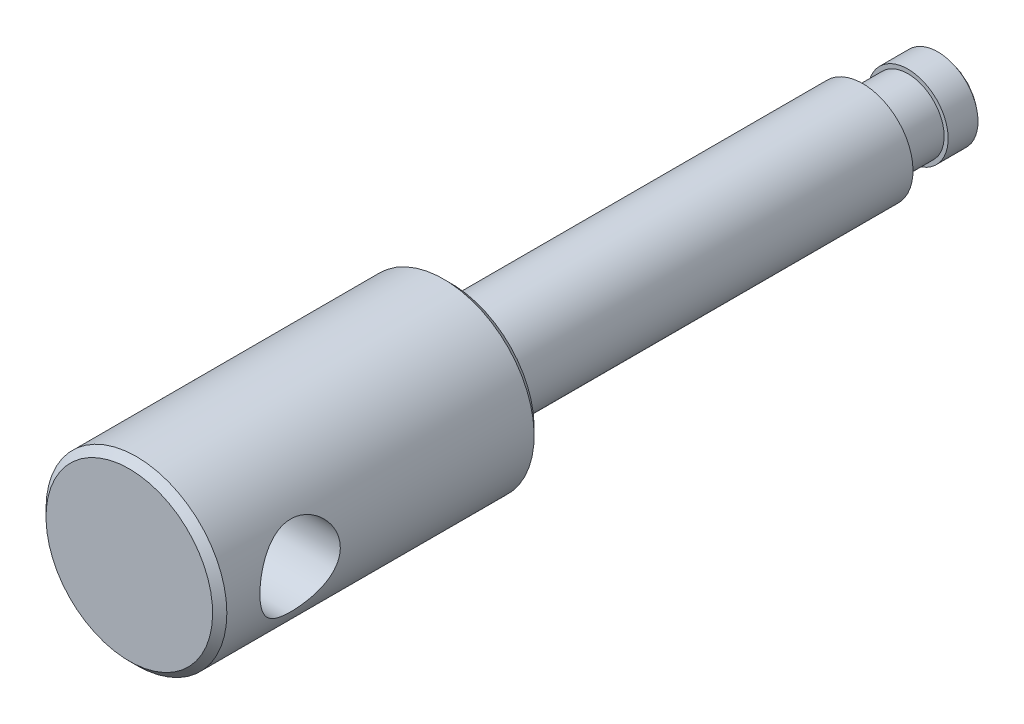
ISO-10303-21;
HEADER;
FILE_DESCRIPTION(('STEP AP214'),'2;1');
FILE_NAME('part.step','',(''),(''),'','','');
FILE_SCHEMA(('AUTOMOTIVE_DESIGN { 1 0 10303 214 1 1 1 1 }'));
ENDSEC;
DATA;
#1=APPLICATION_CONTEXT('core data for automotive mechanical design processes');
#2=APPLICATION_PROTOCOL_DEFINITION('international standard','automotive_design',2000,#1);
#3=PRODUCT_CONTEXT('',#1,'mechanical');
#4=PRODUCT('Part','Part','',(#3));
#5=PRODUCT_RELATED_PRODUCT_CATEGORY('part','',(#4));
#6=PRODUCT_DEFINITION_FORMATION('','',#4);
#7=PRODUCT_DEFINITION_CONTEXT('part definition',#1,'design');
#8=PRODUCT_DEFINITION('design','',#6,#7);
#9=PRODUCT_DEFINITION_SHAPE('','',#8);
#10=(LENGTH_UNIT() NAMED_UNIT(*) SI_UNIT(.MILLI.,.METRE.));
#11=(NAMED_UNIT(*) PLANE_ANGLE_UNIT() SI_UNIT($,.RADIAN.));
#12=(NAMED_UNIT(*) SI_UNIT($,.STERADIAN.) SOLID_ANGLE_UNIT());
#13=UNCERTAINTY_MEASURE_WITH_UNIT(LENGTH_MEASURE(1.E-05),#10,'distance_accuracy_value','');
#14=(GEOMETRIC_REPRESENTATION_CONTEXT(3) GLOBAL_UNCERTAINTY_ASSIGNED_CONTEXT((#13)) GLOBAL_UNIT_ASSIGNED_CONTEXT((#10,
#11,#12)) REPRESENTATION_CONTEXT('',''));
#15=CARTESIAN_POINT('',(0.,0.,0.));
#16=DIRECTION('',(0.,0.,1.));
#17=DIRECTION('',(1.,0.,0.));
#18=AXIS2_PLACEMENT_3D('',#15,#16,#17);
#19=CARTESIAN_POINT('',(0.,0.,6.));
#20=DIRECTION('',(-1.,0.,0.));
#21=DIRECTION('',(0.,1.,0.));
#22=AXIS2_PLACEMENT_3D('',#19,#20,#21);
#23=SPHERICAL_SURFACE('',#22,6.);
#24=CARTESIAN_POINT('',(0.,0.,1.52786404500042));
#25=DIRECTION('',(0.,0.,1.));
#26=DIRECTION('',(0.,-1.,0.));
#27=AXIS2_PLACEMENT_3D('',#24,#25,#26);
#28=CIRCLE('',#27,4.);
#29=CARTESIAN_POINT('',(0.,-4.,1.52786404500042));
#30=VERTEX_POINT('',#29);
#31=EDGE_CURVE('E112',#30,#30,#28,.T.);
#32=ORIENTED_EDGE('',*,*,#31,.F.);
#33=EDGE_LOOP('',(#32));
#34=FACE_BOUND('',#33,.T.);
#35=ADVANCED_FACE('F12',(#34),#23,.T.);
#36=CARTESIAN_POINT('',(0.,0.,0.));
#37=DIRECTION('',(0.,0.,1.));
#38=DIRECTION('',(0.,-1.,0.));
#39=AXIS2_PLACEMENT_3D('',#36,#37,#38);
#40=CYLINDRICAL_SURFACE('',#39,4.);
#41=CARTESIAN_POINT('',(0.,0.,4.5));
#42=DIRECTION('',(0.,0.,1.));
#43=DIRECTION('',(0.,-1.,0.));
#44=AXIS2_PLACEMENT_3D('',#41,#42,#43);
#45=CIRCLE('',#44,4.);
#46=CARTESIAN_POINT('',(0.,-4.,4.5));
#47=VERTEX_POINT('',#46);
#48=EDGE_CURVE('E113',#47,#47,#45,.F.);
#49=ORIENTED_EDGE('',*,*,#48,.T.);
#50=EDGE_LOOP('',(#49));
#51=FACE_BOUND('',#50,.T.);
#52=ORIENTED_EDGE('',*,*,#31,.T.);
#53=EDGE_LOOP('',(#52));
#54=FACE_BOUND('',#53,.T.);
#55=ADVANCED_FACE('F75',(#51,#54),#40,.T.);
#56=CARTESIAN_POINT('',(3.6,0.,4.5));
#57=DIRECTION('',(0.,0.,-1.));
#58=DIRECTION('',(0.,1.,0.));
#59=AXIS2_PLACEMENT_3D('',#56,#57,#58);
#60=PLANE('',#59);
#61=CARTESIAN_POINT('',(0.,0.,4.5));
#62=DIRECTION('',(0.,0.,1.));
#63=DIRECTION('',(0.,-1.,0.));
#64=AXIS2_PLACEMENT_3D('',#61,#62,#63);
#65=CIRCLE('',#64,3.6);
#66=CARTESIAN_POINT('',(0.,-3.6,4.5));
#67=VERTEX_POINT('',#66);
#68=EDGE_CURVE('E94',#67,#67,#65,.T.);
#69=ORIENTED_EDGE('',*,*,#68,.F.);
#70=EDGE_LOOP('',(#69));
#71=FACE_BOUND('',#70,.T.);
#72=ORIENTED_EDGE('',*,*,#48,.F.);
#73=EDGE_LOOP('',(#72));
#74=FACE_BOUND('',#73,.T.);
#75=ADVANCED_FACE('F71',(#71,#74),#60,.F.);
#76=CARTESIAN_POINT('',(0.,0.,0.));
#77=DIRECTION('',(0.,0.,1.));
#78=DIRECTION('',(0.,-1.,0.));
#79=AXIS2_PLACEMENT_3D('',#76,#77,#78);
#80=CYLINDRICAL_SURFACE('',#79,3.6);
#81=CARTESIAN_POINT('',(0.,0.,8.19170962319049));
#82=DIRECTION('',(0.,0.,1.));
#83=DIRECTION('',(0.,-1.,0.));
#84=AXIS2_PLACEMENT_3D('',#81,#82,#83);
#85=CIRCLE('',#84,3.60000000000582);
#86=CARTESIAN_POINT('',(0.,-3.60000000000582,8.19170962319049));
#87=VERTEX_POINT('',#86);
#88=EDGE_CURVE('E90',#87,#87,#85,.T.);
#89=ORIENTED_EDGE('',*,*,#88,.F.);
#90=EDGE_LOOP('',(#89));
#91=FACE_BOUND('',#90,.T.);
#92=ORIENTED_EDGE('',*,*,#68,.T.);
#93=EDGE_LOOP('',(#92));
#94=FACE_BOUND('',#93,.T.);
#95=ADVANCED_FACE('F67',(#91,#94),#80,.T.);
#96=CARTESIAN_POINT('',(0.,0.,9.00000000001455));
#97=DIRECTION('',(0.,0.,1.));
#98=DIRECTION('',(0.,-1.,0.));
#99=AXIS2_PLACEMENT_3D('',#96,#97,#98);
#100=CONICAL_SURFACE('',#99,4.99999999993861,1.047197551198);
#101=CARTESIAN_POINT('',(0.,0.,9.));
#102=DIRECTION('',(0.,0.,1.));
#103=DIRECTION('',(0.,-1.,0.));
#104=AXIS2_PLACEMENT_3D('',#101,#102,#103);
#105=CIRCLE('',#104,5.);
#106=CARTESIAN_POINT('',(0.,-5.,9.));
#107=VERTEX_POINT('',#106);
#108=EDGE_CURVE('E97',#107,#107,#105,.T.);
#109=ORIENTED_EDGE('',*,*,#108,.F.);
#110=EDGE_LOOP('',(#109));
#111=FACE_BOUND('',#110,.T.);
#112=ORIENTED_EDGE('',*,*,#88,.T.);
#113=EDGE_LOOP('',(#112));
#114=FACE_BOUND('',#113,.T.);
#115=ADVANCED_FACE('F63',(#111,#114),#100,.T.);
#116=CARTESIAN_POINT('',(0.,0.,0.));
#117=DIRECTION('',(0.,0.,1.));
#118=DIRECTION('',(0.,-1.,0.));
#119=AXIS2_PLACEMENT_3D('',#116,#117,#118);
#120=CYLINDRICAL_SURFACE('',#119,5.);
#121=CARTESIAN_POINT('',(0.,0.,50.));
#122=DIRECTION('',(0.,0.,1.));
#123=DIRECTION('',(0.,-1.,0.));
#124=AXIS2_PLACEMENT_3D('',#121,#122,#123);
#125=CIRCLE('',#124,5.);
#126=CARTESIAN_POINT('',(0.,-5.,50.));
#127=VERTEX_POINT('',#126);
#128=EDGE_CURVE('E93',#127,#127,#125,.F.);
#129=ORIENTED_EDGE('',*,*,#128,.T.);
#130=EDGE_LOOP('',(#129));
#131=FACE_BOUND('',#130,.T.);
#132=ORIENTED_EDGE('',*,*,#108,.T.);
#133=EDGE_LOOP('',(#132));
#134=FACE_BOUND('',#133,.T.);
#135=ADVANCED_FACE('F59',(#131,#134),#120,.T.);
#136=CARTESIAN_POINT('',(8.29289321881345,0.,50.));
#137=DIRECTION('',(0.,0.,1.));
#138=DIRECTION('',(0.,-1.,0.));
#139=AXIS2_PLACEMENT_3D('',#136,#137,#138);
#140=PLANE('',#139);
#141=CARTESIAN_POINT('',(0.,0.,50.));
#142=DIRECTION('',(0.,0.,1.));
#143=DIRECTION('',(0.,-1.,0.));
#144=AXIS2_PLACEMENT_3D('',#141,#142,#143);
#145=CIRCLE('',#144,8.29289321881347);
#146=CARTESIAN_POINT('',(0.,-8.29289321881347,50.));
#147=VERTEX_POINT('',#146);
#148=EDGE_CURVE('E100',#147,#147,#145,.T.);
#149=ORIENTED_EDGE('',*,*,#148,.F.);
#150=EDGE_LOOP('',(#149));
#151=FACE_BOUND('',#150,.T.);
#152=ORIENTED_EDGE('',*,*,#128,.F.);
#153=EDGE_LOOP('',(#152));
#154=FACE_BOUND('',#153,.T.);
#155=ADVANCED_FACE('F55',(#151,#154),#140,.F.);
#156=CARTESIAN_POINT('',(0.,0.,82.));
#157=DIRECTION('',(0.,0.,-1.));
#158=DIRECTION('',(0.,1.,0.));
#159=AXIS2_PLACEMENT_3D('',#156,#157,#158);
#160=PLANE('',#159);
#161=CARTESIAN_POINT('',(0.,0.,82.));
#162=DIRECTION('',(0.,0.,-1.));
#163=DIRECTION('',(0.,1.,0.));
#164=AXIS2_PLACEMENT_3D('',#161,#162,#163);
#165=CIRCLE('',#164,8.29289321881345);
#166=CARTESIAN_POINT('',(0.,8.29289321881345,82.));
#167=VERTEX_POINT('',#166);
#168=EDGE_CURVE('E86',#167,#167,#165,.T.);
#169=ORIENTED_EDGE('',*,*,#168,.F.);
#170=EDGE_LOOP('',(#169));
#171=FACE_BOUND('',#170,.T.);
#172=ADVANCED_FACE('F51',(#171),#160,.F.);
#173=CARTESIAN_POINT('',(0.,0.,50.7071067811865));
#174=DIRECTION('',(0.,0.,1.));
#175=DIRECTION('',(0.,-1.,0.));
#176=AXIS2_PLACEMENT_3D('',#173,#174,#175);
#177=CONICAL_SURFACE('',#176,9.,0.785398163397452);
#178=CARTESIAN_POINT('',(0.,0.,50.7071067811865));
#179=DIRECTION('',(0.,0.,1.));
#180=DIRECTION('',(0.,-1.,0.));
#181=AXIS2_PLACEMENT_3D('',#178,#179,#180);
#182=CIRCLE('',#181,9.);
#183=CARTESIAN_POINT('',(0.,-9.,50.7071067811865));
#184=VERTEX_POINT('',#183);
#185=EDGE_CURVE('E27',#184,#184,#182,.T.);
#186=ORIENTED_EDGE('',*,*,#185,.F.);
#187=EDGE_LOOP('',(#186));
#188=FACE_BOUND('',#187,.T.);
#189=ORIENTED_EDGE('',*,*,#148,.T.);
#190=EDGE_LOOP('',(#189));
#191=FACE_BOUND('',#190,.T.);
#192=ADVANCED_FACE('F47',(#188,#191),#177,.T.);
#193=CARTESIAN_POINT('',(0.,0.,81.2928932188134));
#194=DIRECTION('',(0.,0.,-1.));
#195=DIRECTION('',(0.,1.,0.));
#196=AXIS2_PLACEMENT_3D('',#193,#194,#195);
#197=CONICAL_SURFACE('',#196,9.,0.785398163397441);
#198=ORIENTED_EDGE('',*,*,#168,.T.);
#199=EDGE_LOOP('',(#198));
#200=FACE_BOUND('',#199,.T.);
#201=CARTESIAN_POINT('',(0.,0.,81.2928932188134));
#202=DIRECTION('',(0.,0.,1.));
#203=DIRECTION('',(0.,-1.,0.));
#204=AXIS2_PLACEMENT_3D('',#201,#202,#203);
#205=CIRCLE('',#204,9.);
#206=CARTESIAN_POINT('',(0.,-9.,81.2928932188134));
#207=VERTEX_POINT('',#206);
#208=EDGE_CURVE('E31',#207,#207,#205,.F.);
#209=ORIENTED_EDGE('',*,*,#208,.F.);
#210=EDGE_LOOP('',(#209));
#211=FACE_BOUND('',#210,.T.);
#212=ADVANCED_FACE('F42',(#200,#211),#197,.T.);
#213=CARTESIAN_POINT('',(0.,0.,0.));
#214=DIRECTION('',(0.,0.,1.));
#215=DIRECTION('',(0.,-1.,0.));
#216=AXIS2_PLACEMENT_3D('',#213,#214,#215);
#217=CYLINDRICAL_SURFACE('',#216,9.);
#218=CARTESIAN_POINT('',(-8.06225774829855,4.,74.));
#219=CARTESIAN_POINT('',(-8.06225871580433,3.99999911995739,73.8940426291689));
#220=CARTESIAN_POINT('',(-8.06435392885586,3.99578365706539,73.7880560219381));
#221=CARTESIAN_POINT('',(-8.07266315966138,3.9789689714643,73.5768687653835));
#222=CARTESIAN_POINT('',(-8.07887962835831,3.96636475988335,73.4716686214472));
#223=CARTESIAN_POINT('',(-8.09523141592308,3.93288406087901,73.2626821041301));
#224=CARTESIAN_POINT('',(-8.10537442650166,3.91199133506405,73.1588989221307));
#225=CARTESIAN_POINT('',(-8.12922894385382,3.8621744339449,72.9536831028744));
#226=CARTESIAN_POINT('',(-8.1429419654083,3.83324684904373,72.8522514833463));
#227=CARTESIAN_POINT('',(-8.18864631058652,3.73514516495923,72.5534876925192));
#228=CARTESIAN_POINT('',(-8.2253027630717,3.65446024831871,72.3605118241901));
#229=CARTESIAN_POINT('',(-8.30683459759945,3.46512080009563,71.9909863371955));
#230=CARTESIAN_POINT('',(-8.35170881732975,3.35647022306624,71.8144344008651));
#231=CARTESIAN_POINT('',(-8.44818605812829,3.1060059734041,71.469998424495));
#232=CARTESIAN_POINT('',(-8.50003637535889,2.96250577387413,71.3034071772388));
#233=CARTESIAN_POINT('',(-8.60260345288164,2.64995455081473,70.9956903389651));
#234=CARTESIAN_POINT('',(-8.65331973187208,2.48089290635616,70.8545753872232));
#235=CARTESIAN_POINT('',(-8.75098098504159,2.11153557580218,70.5948734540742));
#236=CARTESIAN_POINT('',(-8.79760568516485,1.91009295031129,70.477786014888));
#237=CARTESIAN_POINT('',(-8.87874924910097,1.48791769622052,70.2797334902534));
#238=CARTESIAN_POINT('',(-8.91327418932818,1.26719481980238,70.1987502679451));
#239=CARTESIAN_POINT('',(-8.96456719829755,0.826358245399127,70.0800307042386));
#240=CARTESIAN_POINT('',(-8.98225241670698,0.606957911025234,70.0400501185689));
#241=CARTESIAN_POINT('',(-9.00123386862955,0.163899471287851,69.9971753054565));
#242=CARTESIAN_POINT('',(-9.00253773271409,-0.0597566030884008,69.9942638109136));
#243=CARTESIAN_POINT('',(-8.9891172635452,-0.488489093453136,70.0245297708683));
#244=CARTESIAN_POINT('',(-8.97549378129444,-0.69378181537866,70.0552284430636));
#245=CARTESIAN_POINT('',(-8.93530946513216,-1.09594639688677,70.1475366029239));
#246=CARTESIAN_POINT('',(-8.90874767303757,-1.2928176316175,70.2091483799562));
#247=CARTESIAN_POINT('',(-8.84470124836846,-1.67619924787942,70.3621943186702));
#248=CARTESIAN_POINT('',(-8.80705628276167,-1.86250594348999,70.4540687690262));
#249=CARTESIAN_POINT('',(-8.72443358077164,-2.2175508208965,70.6645696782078));
#250=CARTESIAN_POINT('',(-8.67945317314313,-2.38628256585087,70.7832058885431));
#251=CARTESIAN_POINT('',(-8.58241773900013,-2.7154801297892,71.054628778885));
#252=CARTESIAN_POINT('',(-8.53008453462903,-2.8742540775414,71.209366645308));
#253=CARTESIAN_POINT('',(-8.42674548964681,-3.16444740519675,71.5433403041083));
#254=CARTESIAN_POINT('',(-8.37574032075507,-3.29585316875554,71.7225882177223));
#255=CARTESIAN_POINT('',(-8.30349353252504,-3.47221412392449,72.0107379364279));
#256=CARTESIAN_POINT('',(-8.27968910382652,-3.52844732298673,72.1122551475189));
#257=CARTESIAN_POINT('',(-8.23475847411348,-3.63207089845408,72.3202557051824));
#258=CARTESIAN_POINT('',(-8.2136310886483,-3.67946519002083,72.4267368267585));
#259=CARTESIAN_POINT('',(-8.17480574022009,-3.76493796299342,72.6439523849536));
#260=CARTESIAN_POINT('',(-8.15710705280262,-3.80301841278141,72.754685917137));
#261=CARTESIAN_POINT('',(-8.12581877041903,-3.86942100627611,72.9795529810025));
#262=CARTESIAN_POINT('',(-8.11222690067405,-3.89774855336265,73.0936845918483));
#263=CARTESIAN_POINT('',(-8.09048889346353,-3.94265987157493,73.3163267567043));
#264=CARTESIAN_POINT('',(-8.08202710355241,-3.95992921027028,73.4246684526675));
#265=CARTESIAN_POINT('',(-8.06944257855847,-3.98551143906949,73.6426081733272));
#266=CARTESIAN_POINT('',(-8.06531779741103,-3.99382855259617,73.7522055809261));
#267=CARTESIAN_POINT('',(-8.06156002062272,-4.00140826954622,73.9717723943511));
#268=CARTESIAN_POINT('',(-8.06192629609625,-4.00067234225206,74.0817417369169));
#269=CARTESIAN_POINT('',(-8.06713428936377,-3.99016019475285,74.3011360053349));
#270=CARTESIAN_POINT('',(-8.07197583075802,-3.9803843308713,74.4105609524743));
#271=CARTESIAN_POINT('',(-8.08540695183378,-3.95302498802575,74.6195308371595));
#272=CARTESIAN_POINT('',(-8.09367676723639,-3.93610575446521,74.7191839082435));
#273=CARTESIAN_POINT('',(-8.11360050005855,-3.89486887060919,74.9166144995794));
#274=CARTESIAN_POINT('',(-8.12525556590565,-3.87054870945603,75.0143913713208));
#275=CARTESIAN_POINT('',(-8.16479240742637,-3.78682316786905,75.3039409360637));
#276=CARTESIAN_POINT('',(-8.19725658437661,-3.71663214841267,75.4920869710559));
#277=CARTESIAN_POINT('',(-8.27248834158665,-3.54611617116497,75.8623985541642));
#278=CARTESIAN_POINT('',(-8.31565196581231,-3.44458335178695,76.0439197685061));
#279=CARTESIAN_POINT('',(-8.40692978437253,-3.21539109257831,76.3883189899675));
#280=CARTESIAN_POINT('',(-8.45504630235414,-3.08771936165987,76.5511881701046));
#281=CARTESIAN_POINT('',(-8.55631670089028,-2.79562298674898,76.8697587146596));
#282=CARTESIAN_POINT('',(-8.6095148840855,-2.62885906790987,77.0233092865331));
#283=CARTESIAN_POINT('',(-8.71080374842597,-2.2707901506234,77.3007272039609));
#284=CARTESIAN_POINT('',(-8.75889370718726,-2.07948168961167,77.4245903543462));
#285=CARTESIAN_POINT('',(-8.84519710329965,-1.67498083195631,77.6396869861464));
#286=CARTESIAN_POINT('',(-8.88332261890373,-1.46161537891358,77.730632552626));
#287=CARTESIAN_POINT('',(-8.94472578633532,-1.02045840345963,77.8745834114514));
#288=CARTESIAN_POINT('',(-8.96801362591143,-0.792676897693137,77.9276147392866));
#289=CARTESIAN_POINT('',(-8.99580137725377,-0.348228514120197,77.9906336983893));
#290=CARTESIAN_POINT('',(-9.00161841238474,-0.132069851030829,78.00364083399));
#291=CARTESIAN_POINT('',(-8.99760436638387,0.299340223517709,77.9946102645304));
#292=CARTESIAN_POINT('',(-8.98777674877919,0.514591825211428,77.9725803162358));
#293=CARTESIAN_POINT('',(-8.954312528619,0.928153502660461,77.8962552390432));
#294=CARTESIAN_POINT('',(-8.93130800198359,1.12679150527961,77.8434351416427));
#295=CARTESIAN_POINT('',(-8.87418367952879,1.51223596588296,77.7087522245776));
#296=CARTESIAN_POINT('',(-8.84006193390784,1.69904034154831,77.6268843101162));
#297=CARTESIAN_POINT('',(-8.76198674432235,2.06499399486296,77.4323035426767));
#298=CARTESIAN_POINT('',(-8.71765436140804,2.24339999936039,77.3183489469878));
#299=CARTESIAN_POINT('',(-8.62423537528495,2.57934407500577,77.0645296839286));
#300=CARTESIAN_POINT('',(-8.5751467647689,2.73687326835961,76.9246540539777));
#301=CARTESIAN_POINT('',(-8.47281938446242,3.03954409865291,76.6100798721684));
#302=CARTESIAN_POINT('',(-8.41955831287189,3.18273227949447,76.4335061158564));
#303=CARTESIAN_POINT('',(-8.31863267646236,3.43791440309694,76.057266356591));
#304=CARTESIAN_POINT('',(-8.27097161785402,3.5498888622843,75.8575860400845));
#305=CARTESIAN_POINT('',(-8.20816019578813,3.69171847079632,75.5441803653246));
#306=CARTESIAN_POINT('',(-8.18863116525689,3.73471557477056,75.4371069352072));
#307=CARTESIAN_POINT('',(-8.15320381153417,3.81143772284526,75.219125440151));
#308=CARTESIAN_POINT('',(-8.13730367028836,3.845167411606,75.1082193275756));
#309=CARTESIAN_POINT('',(-8.10978099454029,3.90288007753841,74.8837044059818));
#310=CARTESIAN_POINT('',(-8.09814723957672,3.92688863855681,74.7701035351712));
#311=CARTESIAN_POINT('',(-8.07957808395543,3.96495546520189,74.5409253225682));
#312=CARTESIAN_POINT('',(-8.07263915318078,3.9790212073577,74.4253495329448));
#313=CARTESIAN_POINT('',(-8.06621715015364,3.99201145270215,74.2578957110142));
#314=CARTESIAN_POINT('',(-8.06473388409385,3.99500589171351,74.2063769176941));
#315=CARTESIAN_POINT('',(-8.06275393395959,3.999000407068,74.103241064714));
#316=CARTESIAN_POINT('',(-8.06225727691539,4.00000042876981,74.0516240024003));
#317=CARTESIAN_POINT('',(-8.06225774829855,4.,74.));
#318=B_SPLINE_CURVE_WITH_KNOTS('',3,(#218,#219,#220,#221,#222,#223,#224,#225,#226,#227,#228,
#229,#230,#231,#232,#233,#234,#235,#236,#237,#238,#239,#240,#241,#242,#243,#244,#245,#246,#247,
#248,#249,#250,#251,#252,#253,#254,#255,#256,#257,#258,#259,#260,#261,#262,#263,#264,#265,#266,
#267,#268,#269,#270,#271,#272,#273,#274,#275,#276,#277,#278,#279,#280,#281,#282,#283,#284,#285,
#286,#287,#288,#289,#290,#291,#292,#293,#294,#295,#296,#297,#298,#299,#300,#301,#302,#303,#304,
#305,#306,#307,#308,#309,#310,#311,#312,#313,#314,#315,#316,#317),.UNSPECIFIED.,.T.,.F.,(4,2,2,
2,2,2,2,2,2,2,2,2,2,2,2,2,2,2,2,2,2,2,2,2,2,2,2,2,2,2,2,2,2,2,2,2,2,2,2,2,2,2,2,2,2,2,2,2,2,4),
(0.,0.317818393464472,0.635825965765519,0.954459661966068,1.27322877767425,1.90722874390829,
2.54113910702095,3.21592082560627,3.89098369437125,4.60017396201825,5.30900756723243,
5.97655382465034,6.64378912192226,7.26493832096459,7.88613352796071,8.51679809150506,
9.14769283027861,9.82817138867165,10.5089876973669,10.8640051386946,11.2188649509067,
11.5736497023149,11.9282375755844,12.2578989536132,12.5874047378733,12.9168570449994,
13.2462963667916,13.5501886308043,13.8541841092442,14.4617122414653,15.0964254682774,
15.7314378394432,16.4267756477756,17.1222116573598,17.8235911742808,18.5244885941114,
19.1710234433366,19.8174151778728,20.435125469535,21.0529441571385,21.6990794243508,
22.3454885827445,23.0428199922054,23.7405857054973,24.0912600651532,24.4417583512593,
24.7913281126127,25.1406347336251,25.2954763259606,25.4503221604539),.UNSPECIFIED.);
#319=CARTESIAN_POINT('',(-8.06225774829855,4.,74.));
#320=VERTEX_POINT('',#319);
#321=EDGE_CURVE('E23',#320,#320,#318,.T.);
#322=ORIENTED_EDGE('',*,*,#321,.F.);
#323=EDGE_LOOP('',(#322));
#324=FACE_BOUND('',#323,.T.);
#325=ORIENTED_EDGE('',*,*,#208,.T.);
#326=EDGE_LOOP('',(#325));
#327=FACE_BOUND('',#326,.T.);
#328=CARTESIAN_POINT('',(8.06225774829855,4.,74.));
#329=CARTESIAN_POINT('',(8.06225871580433,3.99999911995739,74.1059573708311));
#330=CARTESIAN_POINT('',(8.06435392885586,3.99578365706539,74.2119439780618));
#331=CARTESIAN_POINT('',(8.07266315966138,3.9789689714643,74.4231312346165));
#332=CARTESIAN_POINT('',(8.07887962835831,3.96636475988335,74.5283313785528));
#333=CARTESIAN_POINT('',(8.09523141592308,3.93288406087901,74.7373178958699));
#334=CARTESIAN_POINT('',(8.10537442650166,3.91199133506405,74.8411010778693));
#335=CARTESIAN_POINT('',(8.12922894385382,3.8621744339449,75.0463168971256));
#336=CARTESIAN_POINT('',(8.1429419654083,3.83324684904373,75.1477485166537));
#337=CARTESIAN_POINT('',(8.18864631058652,3.73514516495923,75.4465123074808));
#338=CARTESIAN_POINT('',(8.2253027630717,3.6544602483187,75.6394881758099));
#339=CARTESIAN_POINT('',(8.30683459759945,3.46512080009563,76.0090136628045));
#340=CARTESIAN_POINT('',(8.35170881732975,3.35647022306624,76.1855655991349));
#341=CARTESIAN_POINT('',(8.44818605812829,3.1060059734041,76.530001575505));
#342=CARTESIAN_POINT('',(8.50003637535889,2.96250577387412,76.6965928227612));
#343=CARTESIAN_POINT('',(8.60260345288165,2.64995455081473,77.0043096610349));
#344=CARTESIAN_POINT('',(8.65331973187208,2.48089290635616,77.1454246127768));
#345=CARTESIAN_POINT('',(8.75098098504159,2.11153557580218,77.4051265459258));
#346=CARTESIAN_POINT('',(8.79760568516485,1.91009295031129,77.522213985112));
#347=CARTESIAN_POINT('',(8.87874924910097,1.48791769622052,77.7202665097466));
#348=CARTESIAN_POINT('',(8.91327418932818,1.26719481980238,77.8012497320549));
#349=CARTESIAN_POINT('',(8.96456719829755,0.826358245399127,77.9199692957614));
#350=CARTESIAN_POINT('',(8.98225241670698,0.606957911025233,77.9599498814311));
#351=CARTESIAN_POINT('',(9.00123386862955,0.16389947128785,78.0028246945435));
#352=CARTESIAN_POINT('',(9.00253773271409,-0.0597566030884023,78.0057361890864));
#353=CARTESIAN_POINT('',(8.9891172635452,-0.488489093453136,77.9754702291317));
#354=CARTESIAN_POINT('',(8.97549378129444,-0.693781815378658,77.9447715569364));
#355=CARTESIAN_POINT('',(8.93530946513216,-1.09594639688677,77.8524633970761));
#356=CARTESIAN_POINT('',(8.90874767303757,-1.2928176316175,77.7908516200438));
#357=CARTESIAN_POINT('',(8.84470124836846,-1.67619924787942,77.6378056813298));
#358=CARTESIAN_POINT('',(8.80705628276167,-1.86250594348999,77.5459312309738));
#359=CARTESIAN_POINT('',(8.72443358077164,-2.2175508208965,77.3354303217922));
#360=CARTESIAN_POINT('',(8.67945317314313,-2.38628256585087,77.2167941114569));
#361=CARTESIAN_POINT('',(8.58241773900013,-2.71548012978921,76.945371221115));
#362=CARTESIAN_POINT('',(8.53008453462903,-2.8742540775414,76.790633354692));
#363=CARTESIAN_POINT('',(8.42674548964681,-3.16444740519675,76.4566596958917));
#364=CARTESIAN_POINT('',(8.37574032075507,-3.29585316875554,76.2774117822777));
#365=CARTESIAN_POINT('',(8.30349353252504,-3.47221412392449,75.9892620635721));
#366=CARTESIAN_POINT('',(8.27968910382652,-3.52844732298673,75.8877448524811));
#367=CARTESIAN_POINT('',(8.23475847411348,-3.63207089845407,75.6797442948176));
#368=CARTESIAN_POINT('',(8.2136310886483,-3.67946519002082,75.5732631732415));
#369=CARTESIAN_POINT('',(8.17480574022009,-3.76493796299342,75.3560476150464));
#370=CARTESIAN_POINT('',(8.15710705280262,-3.80301841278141,75.245314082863));
#371=CARTESIAN_POINT('',(8.12581877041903,-3.86942100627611,75.0204470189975));
#372=CARTESIAN_POINT('',(8.11222690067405,-3.89774855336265,74.9063154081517));
#373=CARTESIAN_POINT('',(8.09048889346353,-3.94265987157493,74.6836732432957));
#374=CARTESIAN_POINT('',(8.08202710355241,-3.95992921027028,74.5753315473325));
#375=CARTESIAN_POINT('',(8.06944257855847,-3.98551143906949,74.3573918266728));
#376=CARTESIAN_POINT('',(8.06531779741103,-3.99382855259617,74.2477944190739));
#377=CARTESIAN_POINT('',(8.06156002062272,-4.00140826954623,74.0282276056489));
#378=CARTESIAN_POINT('',(8.06192629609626,-4.00067234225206,73.9182582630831));
#379=CARTESIAN_POINT('',(8.06713428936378,-3.99016019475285,73.6988639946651));
#380=CARTESIAN_POINT('',(8.07197583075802,-3.9803843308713,73.5894390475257));
#381=CARTESIAN_POINT('',(8.08540695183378,-3.95302498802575,73.3804691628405));
#382=CARTESIAN_POINT('',(8.09367676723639,-3.93610575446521,73.2808160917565));
#383=CARTESIAN_POINT('',(8.11360050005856,-3.89486887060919,73.0833855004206));
#384=CARTESIAN_POINT('',(8.12525556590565,-3.87054870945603,72.9856086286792));
#385=CARTESIAN_POINT('',(8.16479240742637,-3.78682316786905,72.6960590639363));
#386=CARTESIAN_POINT('',(8.19725658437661,-3.71663214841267,72.5079130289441));
#387=CARTESIAN_POINT('',(8.27248834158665,-3.54611617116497,72.1376014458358));
#388=CARTESIAN_POINT('',(8.31565196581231,-3.44458335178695,71.956080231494));
#389=CARTESIAN_POINT('',(8.40692978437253,-3.21539109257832,71.6116810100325));
#390=CARTESIAN_POINT('',(8.45504630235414,-3.08771936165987,71.4488118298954));
#391=CARTESIAN_POINT('',(8.55631670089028,-2.79562298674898,71.1302412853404));
#392=CARTESIAN_POINT('',(8.6095148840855,-2.62885906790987,70.9766907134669));
#393=CARTESIAN_POINT('',(8.71080374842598,-2.2707901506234,70.6992727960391));
#394=CARTESIAN_POINT('',(8.75889370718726,-2.07948168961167,70.5754096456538));
#395=CARTESIAN_POINT('',(8.84519710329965,-1.67498083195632,70.3603130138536));
#396=CARTESIAN_POINT('',(8.88332261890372,-1.46161537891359,70.269367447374));
#397=CARTESIAN_POINT('',(8.94472578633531,-1.02045840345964,70.1254165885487));
#398=CARTESIAN_POINT('',(8.96801362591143,-0.792676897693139,70.0723852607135));
#399=CARTESIAN_POINT('',(8.99580137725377,-0.348228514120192,70.0093663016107));
#400=CARTESIAN_POINT('',(9.00161841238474,-0.132069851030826,69.99635916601));
#401=CARTESIAN_POINT('',(8.99760436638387,0.299340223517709,70.0053897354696));
#402=CARTESIAN_POINT('',(8.98777674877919,0.514591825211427,70.0274196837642));
#403=CARTESIAN_POINT('',(8.954312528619,0.928153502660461,70.1037447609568));
#404=CARTESIAN_POINT('',(8.93130800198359,1.12679150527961,70.1565648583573));
#405=CARTESIAN_POINT('',(8.87418367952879,1.51223596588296,70.2912477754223));
#406=CARTESIAN_POINT('',(8.84006193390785,1.69904034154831,70.3731156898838));
#407=CARTESIAN_POINT('',(8.76198674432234,2.06499399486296,70.5676964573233));
#408=CARTESIAN_POINT('',(8.71765436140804,2.24339999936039,70.6816510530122));
#409=CARTESIAN_POINT('',(8.62423537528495,2.57934407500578,70.9354703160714));
#410=CARTESIAN_POINT('',(8.5751467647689,2.73687326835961,71.0753459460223));
#411=CARTESIAN_POINT('',(8.47281938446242,3.03954409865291,71.3899201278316));
#412=CARTESIAN_POINT('',(8.41955831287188,3.18273227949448,71.5664938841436));
#413=CARTESIAN_POINT('',(8.31863267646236,3.43791440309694,71.942733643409));
#414=CARTESIAN_POINT('',(8.27097161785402,3.5498888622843,72.1424139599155));
#415=CARTESIAN_POINT('',(8.20816019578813,3.69171847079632,72.4558196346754));
#416=CARTESIAN_POINT('',(8.18863116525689,3.73471557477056,72.5628930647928));
#417=CARTESIAN_POINT('',(8.15320381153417,3.81143772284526,72.780874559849));
#418=CARTESIAN_POINT('',(8.13730367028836,3.845167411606,72.8917806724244));
#419=CARTESIAN_POINT('',(8.10978099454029,3.90288007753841,73.1162955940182));
#420=CARTESIAN_POINT('',(8.09814723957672,3.92688863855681,73.2298964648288));
#421=CARTESIAN_POINT('',(8.07957808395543,3.96495546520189,73.4590746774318));
#422=CARTESIAN_POINT('',(8.07263915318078,3.9790212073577,73.5746504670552));
#423=CARTESIAN_POINT('',(8.06621715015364,3.99201145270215,73.7421042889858));
#424=CARTESIAN_POINT('',(8.06473388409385,3.99500589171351,73.7936230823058));
#425=CARTESIAN_POINT('',(8.06275393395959,3.999000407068,73.896758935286));
#426=CARTESIAN_POINT('',(8.06225727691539,4.00000042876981,73.9483759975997));
#427=CARTESIAN_POINT('',(8.06225774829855,4.,74.));
#428=B_SPLINE_CURVE_WITH_KNOTS('',3,(#328,#329,#330,#331,#332,#333,#334,#335,#336,#337,#338,
#339,#340,#341,#342,#343,#344,#345,#346,#347,#348,#349,#350,#351,#352,#353,#354,#355,#356,#357,
#358,#359,#360,#361,#362,#363,#364,#365,#366,#367,#368,#369,#370,#371,#372,#373,#374,#375,#376,
#377,#378,#379,#380,#381,#382,#383,#384,#385,#386,#387,#388,#389,#390,#391,#392,#393,#394,#395,
#396,#397,#398,#399,#400,#401,#402,#403,#404,#405,#406,#407,#408,#409,#410,#411,#412,#413,#414,
#415,#416,#417,#418,#419,#420,#421,#422,#423,#424,#425,#426,#427),.UNSPECIFIED.,.T.,.F.,(4,2,2,
2,2,2,2,2,2,2,2,2,2,2,2,2,2,2,2,2,2,2,2,2,2,2,2,2,2,2,2,2,2,2,2,2,2,2,2,2,2,2,2,2,2,2,2,2,2,4),
(0.,0.317818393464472,0.635825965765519,0.954459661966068,1.27322877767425,1.90722874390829,
2.54113910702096,3.21592082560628,3.89098369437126,4.60017396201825,5.30900756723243,
5.97655382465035,6.64378912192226,7.26493832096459,7.88613352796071,8.51679809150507,
9.14769283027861,9.82817138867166,10.5089876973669,10.8640051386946,11.2188649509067,
11.573649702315,11.9282375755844,12.2578989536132,12.5874047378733,12.9168570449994,
13.2462963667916,13.5501886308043,13.8541841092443,14.4617122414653,15.0964254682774,
15.7314378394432,16.4267756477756,17.1222116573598,17.8235911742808,18.5244885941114,
19.1710234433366,19.8174151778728,20.435125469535,21.0529441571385,21.6990794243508,
22.3454885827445,23.0428199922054,23.7405857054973,24.0912600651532,24.4417583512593,
24.7913281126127,25.1406347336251,25.2954763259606,25.4503221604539),.UNSPECIFIED.);
#429=CARTESIAN_POINT('',(8.06225774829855,4.,74.));
#430=VERTEX_POINT('',#429);
#431=EDGE_CURVE('E8',#430,#430,#428,.T.);
#432=ORIENTED_EDGE('',*,*,#431,.F.);
#433=EDGE_LOOP('',(#432));
#434=FACE_BOUND('',#433,.T.);
#435=ORIENTED_EDGE('',*,*,#185,.T.);
#436=EDGE_LOOP('',(#435));
#437=FACE_BOUND('',#436,.T.);
#438=ADVANCED_FACE('F38',(#324,#327,#434,#437),#217,.T.);
#439=CARTESIAN_POINT('',(-17.0022539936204,0.,74.));
#440=DIRECTION('',(1.,0.,0.));
#441=DIRECTION('',(0.,1.,0.));
#442=AXIS2_PLACEMENT_3D('',#439,#440,#441);
#443=CYLINDRICAL_SURFACE('',#442,4.);
#444=ORIENTED_EDGE('',*,*,#321,.T.);
#445=EDGE_LOOP('',(#444));
#446=FACE_BOUND('',#445,.T.);
#447=ORIENTED_EDGE('',*,*,#431,.T.);
#448=EDGE_LOOP('',(#447));
#449=FACE_BOUND('',#448,.T.);
#450=ADVANCED_FACE('F14',(#446,#449),#443,.F.);
#451=CLOSED_SHELL('',(#35,#55,#75,#95,#115,#135,#155,#172,#192,#212,#438,#450));
#452=MANIFOLD_SOLID_BREP('B1',#451);
#453=ADVANCED_BREP_SHAPE_REPRESENTATION('',(#18,#452),#14);
#454=SHAPE_DEFINITION_REPRESENTATION(#9,#453);
ENDSEC;
END-ISO-10303-21;
